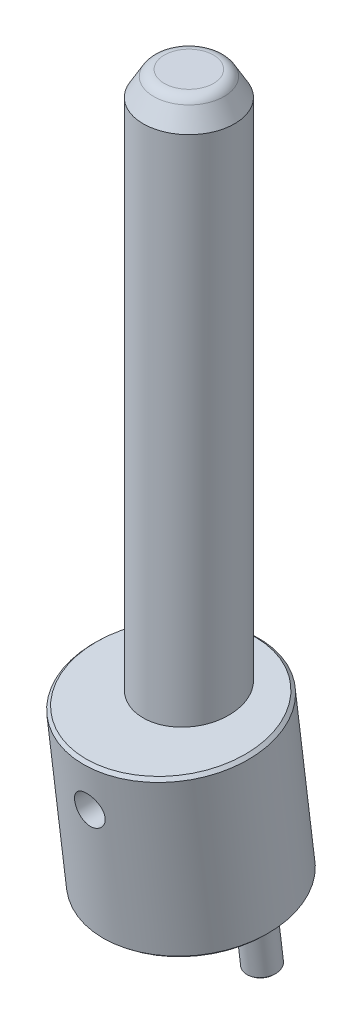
ISO-10303-21;
HEADER;
FILE_DESCRIPTION(('STEP AP214'),'2;1');
FILE_NAME('part.step','',(''),(''),'','','');
FILE_SCHEMA(('AUTOMOTIVE_DESIGN { 1 0 10303 214 1 1 1 1 }'));
ENDSEC;
DATA;
#1=APPLICATION_CONTEXT('core data for automotive mechanical design processes');
#2=APPLICATION_PROTOCOL_DEFINITION('international standard','automotive_design',2000,#1);
#3=PRODUCT_CONTEXT('',#1,'mechanical');
#4=PRODUCT('Part','Part','',(#3));
#5=PRODUCT_RELATED_PRODUCT_CATEGORY('part','',(#4));
#6=PRODUCT_DEFINITION_FORMATION('','',#4);
#7=PRODUCT_DEFINITION_CONTEXT('part definition',#1,'design');
#8=PRODUCT_DEFINITION('design','',#6,#7);
#9=PRODUCT_DEFINITION_SHAPE('','',#8);
#10=(LENGTH_UNIT() NAMED_UNIT(*) SI_UNIT(.MILLI.,.METRE.));
#11=(NAMED_UNIT(*) PLANE_ANGLE_UNIT() SI_UNIT($,.RADIAN.));
#12=(NAMED_UNIT(*) SI_UNIT($,.STERADIAN.) SOLID_ANGLE_UNIT());
#13=UNCERTAINTY_MEASURE_WITH_UNIT(LENGTH_MEASURE(1.E-05),#10,'distance_accuracy_value','');
#14=(GEOMETRIC_REPRESENTATION_CONTEXT(3) GLOBAL_UNCERTAINTY_ASSIGNED_CONTEXT((#13)) GLOBAL_UNIT_ASSIGNED_CONTEXT((#10,
#11,#12)) REPRESENTATION_CONTEXT('',''));
#15=CARTESIAN_POINT('',(0.,0.,0.));
#16=DIRECTION('',(0.,0.,1.));
#17=DIRECTION('',(1.,0.,0.));
#18=AXIS2_PLACEMENT_3D('',#15,#16,#17);
#19=CARTESIAN_POINT('',(0.,-25.2094466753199,-2.57557712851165));
#20=DIRECTION('',(0.,-0.992546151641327,-0.121869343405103));
#21=DIRECTION('',(0.,0.121869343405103,-0.992546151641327));
#22=AXIS2_PLACEMENT_3D('',#19,#20,#21);
#23=PLANE('',#22);
#24=CARTESIAN_POINT('',(-21.5,-25.2094466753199,-2.57557712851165));
#25=DIRECTION('',(0.,-0.992546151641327,-0.121869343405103));
#26=DIRECTION('',(0.,0.121869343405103,-0.992546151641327));
#27=AXIS2_PLACEMENT_3D('',#24,#25,#26);
#28=CIRCLE('',#27,4.50000075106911);
#29=CARTESIAN_POINT('',(-21.5,-24.6610345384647,-7.04203555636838));
#30=VERTEX_POINT('',#29);
#31=EDGE_CURVE('P0_E17',#30,#30,#28,.F.);
#32=ORIENTED_EDGE('',*,*,#31,.F.);
#33=EDGE_LOOP('',(#32));
#34=FACE_BOUND('',#33,.T.);
#35=ADVANCED_FACE('P0_F14',(#34),#23,.T.);
#36=CARTESIAN_POINT('',(0.,-25.2094466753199,-2.57557712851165));
#37=DIRECTION('',(0.,-0.992546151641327,-0.121869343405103));
#38=DIRECTION('',(0.,0.121869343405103,-0.992546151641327));
#39=AXIS2_PLACEMENT_3D('',#36,#37,#38);
#40=PLANE('',#39);
#41=CARTESIAN_POINT('',(21.5,-25.2094466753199,-2.57557712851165));
#42=DIRECTION('',(0.,-0.992546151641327,-0.121869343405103));
#43=DIRECTION('',(0.,0.121869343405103,-0.992546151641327));
#44=AXIS2_PLACEMENT_3D('',#41,#42,#43);
#45=CIRCLE('',#44,4.50000075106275);
#46=CARTESIAN_POINT('',(21.5,-24.6610345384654,-7.04203555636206));
#47=VERTEX_POINT('',#46);
#48=EDGE_CURVE('P0_E121',#47,#47,#45,.F.);
#49=ORIENTED_EDGE('',*,*,#48,.F.);
#50=EDGE_LOOP('',(#49));
#51=FACE_BOUND('',#50,.T.);
#52=ADVANCED_FACE('P0_F111',(#51),#40,.T.);
#53=CARTESIAN_POINT('',(0.,3.12944115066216E-12,-4.77482636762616E-13));
#54=DIRECTION('',(0.,-1.,0.));
#55=DIRECTION('',(0.,0.,-1.));
#56=AXIS2_PLACEMENT_3D('',#53,#54,#55);
#57=PLANE('',#56);
#58=CARTESIAN_POINT('',(0.,2.90045765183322E-12,-2.59850734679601E-12));
#59=DIRECTION('',(0.,-1.,0.));
#60=DIRECTION('',(0.,0.,-1.));
#61=AXIS2_PLACEMENT_3D('',#58,#59,#60);
#62=CIRCLE('',#61,15.);
#63=CARTESIAN_POINT('',(0.,2.90045765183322E-12,-15.0000000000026));
#64=VERTEX_POINT('',#63);
#65=EDGE_CURVE('P0_E36',#64,#64,#62,.F.);
#66=ORIENTED_EDGE('',*,*,#65,.T.);
#67=EDGE_LOOP('',(#66));
#68=FACE_BOUND('',#67,.T.);
#69=ADVANCED_FACE('P0_F108',(#68),#57,.F.);
#70=CARTESIAN_POINT('',(-21.5,-24.7131730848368,-2.51464239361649));
#71=DIRECTION('',(0.,0.992546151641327,0.121869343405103));
#72=DIRECTION('',(0.,-0.121869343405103,0.992546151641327));
#73=AXIS2_PLACEMENT_3D('',#70,#71,#72);
#74=CONICAL_SURFACE('',#73,5.00000135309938,0.785398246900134);
#75=CARTESIAN_POINT('',(-21.5,-24.7131717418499,-2.51464222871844));
#76=DIRECTION('',(0.,-0.992546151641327,-0.121869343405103));
#77=DIRECTION('',(0.,0.121869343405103,-0.992546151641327));
#78=AXIS2_PLACEMENT_3D('',#75,#76,#77);
#79=CIRCLE('',#78,5.);
#80=CARTESIAN_POINT('',(-21.5,-24.1038250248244,-7.47737298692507));
#81=VERTEX_POINT('',#80);
#82=EDGE_CURVE('P0_E33',#81,#81,#79,.F.);
#83=ORIENTED_EDGE('',*,*,#82,.F.);
#84=EDGE_LOOP('',(#83));
#85=FACE_BOUND('',#84,.T.);
#86=ORIENTED_EDGE('',*,*,#31,.T.);
#87=EDGE_LOOP('',(#86));
#88=FACE_BOUND('',#87,.T.);
#89=ADVANCED_FACE('P0_F104',(#85,#88),#74,.T.);
#90=CARTESIAN_POINT('',(21.5,-24.7131730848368,-2.51464239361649));
#91=DIRECTION('',(0.,0.992546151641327,0.121869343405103));
#92=DIRECTION('',(0.,-0.121869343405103,0.992546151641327));
#93=AXIS2_PLACEMENT_3D('',#90,#91,#92);
#94=CONICAL_SURFACE('',#93,5.00000135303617,0.785398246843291);
#95=CARTESIAN_POINT('',(21.5,-24.7131717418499,-2.51464222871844));
#96=DIRECTION('',(0.,-0.992546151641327,-0.121869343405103));
#97=DIRECTION('',(0.,0.121869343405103,-0.992546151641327));
#98=AXIS2_PLACEMENT_3D('',#95,#96,#97);
#99=CIRCLE('',#98,5.);
#100=CARTESIAN_POINT('',(21.5,-24.1038250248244,-7.47737298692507));
#101=VERTEX_POINT('',#100);
#102=EDGE_CURVE('P0_E29',#101,#101,#99,.F.);
#103=ORIENTED_EDGE('',*,*,#102,.F.);
#104=EDGE_LOOP('',(#103));
#105=FACE_BOUND('',#104,.T.);
#106=ORIENTED_EDGE('',*,*,#48,.T.);
#107=EDGE_LOOP('',(#106));
#108=FACE_BOUND('',#107,.T.);
#109=ADVANCED_FACE('P0_F99',(#105,#108),#94,.T.);
#110=CARTESIAN_POINT('',(0.,59.7458556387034,-2.59872418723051E-12));
#111=DIRECTION('',(0.,-1.,0.));
#112=DIRECTION('',(0.,0.,-1.));
#113=AXIS2_PLACEMENT_3D('',#110,#111,#112);
#114=CYLINDRICAL_SURFACE('',#113,15.);
#115=CARTESIAN_POINT('',(0.,45.0000000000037,-2.59959154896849E-12));
#116=DIRECTION('',(0.,0.992546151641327,0.121869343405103));
#117=DIRECTION('',(0.,-0.121869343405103,0.992546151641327));
#118=AXIS2_PLACEMENT_3D('',#115,#116,#117);
#119=ELLIPSE('',#118,15.1126473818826,15.);
#120=CARTESIAN_POINT('',(0.,43.1582315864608,14.9999999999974));
#121=VERTEX_POINT('',#120);
#122=EDGE_CURVE('P0_E32',#121,#121,#119,.F.);
#123=ORIENTED_EDGE('',*,*,#122,.F.);
#124=EDGE_LOOP('',(#123));
#125=FACE_BOUND('',#124,.T.);
#126=ORIENTED_EDGE('',*,*,#65,.F.);
#127=EDGE_LOOP('',(#126));
#128=FACE_BOUND('',#127,.T.);
#129=CARTESIAN_POINT('',(0.,31.0000000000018,14.9999999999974));
#130=CARTESIAN_POINT('',(-0.13627460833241,30.9999999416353,14.9999999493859));
#131=CARTESIAN_POINT('',(-0.27255067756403,30.9944241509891,14.9981386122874));
#132=CARTESIAN_POINT('',(-0.544142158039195,30.9721706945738,14.9907428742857));
#133=CARTESIAN_POINT('',(-0.679457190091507,30.9554888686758,14.9852070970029));
#134=CARTESIAN_POINT('',(-0.948257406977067,30.9111491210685,14.9706027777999));
#135=CARTESIAN_POINT('',(-1.08174007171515,30.8834773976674,14.9615297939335));
#136=CARTESIAN_POINT('',(-1.34580155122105,30.8174009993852,14.9400929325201));
#137=CARTESIAN_POINT('',(-1.47637921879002,30.7789921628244,14.9277277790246));
#138=CARTESIAN_POINT('',(-1.7333461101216,30.6918928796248,14.9000723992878));
#139=CARTESIAN_POINT('',(-1.85974572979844,30.6432305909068,14.8847901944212));
#140=CARTESIAN_POINT('',(-2.10792399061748,30.5359631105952,14.8516789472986));
#141=CARTESIAN_POINT('',(-2.22970089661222,30.4773542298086,14.8338489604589));
#142=CARTESIAN_POINT('',(-2.58680471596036,30.2873070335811,14.7772227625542));
#143=CARTESIAN_POINT('',(-2.81420620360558,30.1415453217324,14.735256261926));
#144=CARTESIAN_POINT('',(-3.24874257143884,29.8108587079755,14.6457020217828));
#145=CARTESIAN_POINT('',(-3.45501840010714,29.6248491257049,14.5979792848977));
#146=CARTESIAN_POINT('',(-3.8341436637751,29.2211801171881,14.5030192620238));
#147=CARTESIAN_POINT('',(-4.0069839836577,29.0035120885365,14.4557821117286));
#148=CARTESIAN_POINT('',(-4.31912807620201,28.5350726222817,14.3656662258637));
#149=CARTESIAN_POINT('',(-4.45732572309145,28.2835298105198,14.322951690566));
#150=CARTESIAN_POINT('',(-4.68909399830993,27.7591186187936,14.2487652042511));
#151=CARTESIAN_POINT('',(-4.78267844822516,27.4862568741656,14.2172897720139));
#152=CARTESIAN_POINT('',(-4.91936749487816,26.9366338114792,14.1705651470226));
#153=CARTESIAN_POINT('',(-4.96406724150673,26.6603139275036,14.1548047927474));
#154=CARTESIAN_POINT('',(-5.00670561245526,26.1036813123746,14.1397828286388));
#155=CARTESIAN_POINT('',(-5.00465868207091,25.8233698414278,14.1405161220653));
#156=CARTESIAN_POINT('',(-4.95509941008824,25.280317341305,14.1579507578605));
#157=CARTESIAN_POINT('',(-4.90966912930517,25.0173587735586,14.1739208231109));
#158=CARTESIAN_POINT('',(-4.77803186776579,24.5030345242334,14.2188326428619));
#159=CARTESIAN_POINT('',(-4.69181981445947,24.2516702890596,14.2477760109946));
#160=CARTESIAN_POINT('',(-4.47968995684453,23.7629279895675,14.3158968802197));
#161=CARTESIAN_POINT('',(-4.3531541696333,23.5258408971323,14.355231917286));
#162=CARTESIAN_POINT('',(-4.06444611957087,23.0756402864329,14.4396288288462));
#163=CARTESIAN_POINT('',(-3.90226546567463,22.8625324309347,14.484692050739));
#164=CARTESIAN_POINT('',(-3.53674216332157,22.4545530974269,14.5783642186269));
#165=CARTESIAN_POINT('',(-3.33169626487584,22.2612084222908,14.6270356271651));
#166=CARTESIAN_POINT('',(-3.00176707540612,21.9988448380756,14.6970107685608));
#167=CARTESIAN_POINT('',(-2.88796886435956,21.9159467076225,14.7198467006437));
#168=CARTESIAN_POINT('',(-2.65358317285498,21.7599196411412,14.763897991));
#169=CARTESIAN_POINT('',(-2.53299841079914,21.6867868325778,14.7851139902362));
#170=CARTESIAN_POINT('',(-2.28442944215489,21.5500863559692,14.8255663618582));
#171=CARTESIAN_POINT('',(-2.15637801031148,21.4866337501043,14.8447781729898));
#172=CARTESIAN_POINT('',(-1.89503347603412,21.3708247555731,14.880397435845));
#173=CARTESIAN_POINT('',(-1.76174256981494,21.3184637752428,14.8968060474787));
#174=CARTESIAN_POINT('',(-1.49104566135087,21.2253547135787,14.9263287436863));
#175=CARTESIAN_POINT('',(-1.3536464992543,21.1845884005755,14.9394479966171));
#176=CARTESIAN_POINT('',(-1.0756272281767,21.1149668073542,14.9620340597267));
#177=CARTESIAN_POINT('',(-0.93500858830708,21.0861062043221,14.9715025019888));
#178=CARTESIAN_POINT('',(-0.662330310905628,21.0422867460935,14.9859443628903));
#179=CARTESIAN_POINT('',(-0.530427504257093,21.0264417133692,14.9912035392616));
#180=CARTESIAN_POINT('',(-0.265683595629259,21.0052983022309,14.9982313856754));
#181=CARTESIAN_POINT('',(-0.132842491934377,20.9999999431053,15.0000000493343));
#182=CARTESIAN_POINT('',(0.136274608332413,21.0000000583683,14.9999999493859));
#183=CARTESIAN_POINT('',(0.272550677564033,21.0055758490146,14.9981386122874));
#184=CARTESIAN_POINT('',(0.544142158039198,21.0278293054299,14.9907428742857));
#185=CARTESIAN_POINT('',(0.67945719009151,21.0445111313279,14.9852070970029));
#186=CARTESIAN_POINT('',(0.94825740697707,21.0888508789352,14.9706027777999));
#187=CARTESIAN_POINT('',(1.08174007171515,21.1165226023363,14.9615297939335));
#188=CARTESIAN_POINT('',(1.34580155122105,21.1825990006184,14.9400929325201));
#189=CARTESIAN_POINT('',(1.47637921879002,21.2210078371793,14.9277277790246));
#190=CARTESIAN_POINT('',(1.7333461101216,21.3081071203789,14.9000723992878));
#191=CARTESIAN_POINT('',(1.85974572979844,21.3567694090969,14.8847901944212));
#192=CARTESIAN_POINT('',(2.10792399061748,21.4640368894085,14.8516789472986));
#193=CARTESIAN_POINT('',(2.22970089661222,21.5226457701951,14.8338489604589));
#194=CARTESIAN_POINT('',(2.58680471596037,21.7126929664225,14.7772227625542));
#195=CARTESIAN_POINT('',(2.81420620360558,21.8584546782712,14.735256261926));
#196=CARTESIAN_POINT('',(3.24874257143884,22.1891412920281,14.6457020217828));
#197=CARTESIAN_POINT('',(3.45501840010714,22.3751508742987,14.5979792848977));
#198=CARTESIAN_POINT('',(3.8341436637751,22.7788198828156,14.5030192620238));
#199=CARTESIAN_POINT('',(4.0069839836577,22.9964879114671,14.4557821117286));
#200=CARTESIAN_POINT('',(4.31912807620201,23.464927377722,14.3656662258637));
#201=CARTESIAN_POINT('',(4.45732572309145,23.7164701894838,14.322951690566));
#202=CARTESIAN_POINT('',(4.68909399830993,24.24088138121,14.2487652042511));
#203=CARTESIAN_POINT('',(4.78267844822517,24.5137431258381,14.2172897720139));
#204=CARTESIAN_POINT('',(4.91936749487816,25.0633661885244,14.1705651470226));
#205=CARTESIAN_POINT('',(4.96406724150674,25.3396860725,14.1548047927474));
#206=CARTESIAN_POINT('',(5.00670561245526,25.896318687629,14.1397828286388));
#207=CARTESIAN_POINT('',(5.00465868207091,26.1766301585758,14.1405161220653));
#208=CARTESIAN_POINT('',(4.95509941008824,26.7196826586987,14.1579507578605));
#209=CARTESIAN_POINT('',(4.90966912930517,26.982641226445,14.1739208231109));
#210=CARTESIAN_POINT('',(4.77803186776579,27.4969654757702,14.2188326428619));
#211=CARTESIAN_POINT('',(4.69181981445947,27.748329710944,14.2477760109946));
#212=CARTESIAN_POINT('',(4.47968995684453,28.2370720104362,14.3158968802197));
#213=CARTESIAN_POINT('',(4.35315416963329,28.4741591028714,14.355231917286));
#214=CARTESIAN_POINT('',(4.06444611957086,28.9243597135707,14.4396288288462));
#215=CARTESIAN_POINT('',(3.90226546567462,29.1374675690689,14.484692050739));
#216=CARTESIAN_POINT('',(3.53674216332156,29.5454469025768,14.5783642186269));
#217=CARTESIAN_POINT('',(3.33169626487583,29.7387915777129,14.6270356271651));
#218=CARTESIAN_POINT('',(3.00176707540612,30.0011551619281,14.6970107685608));
#219=CARTESIAN_POINT('',(2.88796886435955,30.0840532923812,14.7198467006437));
#220=CARTESIAN_POINT('',(2.65358317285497,30.2400803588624,14.763897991));
#221=CARTESIAN_POINT('',(2.53299841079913,30.3132131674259,14.7851139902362));
#222=CARTESIAN_POINT('',(2.28442944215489,30.4499136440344,14.8255663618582));
#223=CARTESIAN_POINT('',(2.15637801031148,30.5133662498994,14.8447781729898));
#224=CARTESIAN_POINT('',(1.89503347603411,30.6291752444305,14.880397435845));
#225=CARTESIAN_POINT('',(1.76174256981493,30.6815362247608,14.8968060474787));
#226=CARTESIAN_POINT('',(1.49104566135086,30.7746452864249,14.9263287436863));
#227=CARTESIAN_POINT('',(1.3536464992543,30.8154115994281,14.9394479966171));
#228=CARTESIAN_POINT('',(1.0756272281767,30.8850331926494,14.9620340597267));
#229=CARTESIAN_POINT('',(0.935008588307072,30.9138937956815,14.9715025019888));
#230=CARTESIAN_POINT('',(0.662330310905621,30.9577132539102,14.9859443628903));
#231=CARTESIAN_POINT('',(0.530427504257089,30.9735582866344,14.9912035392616));
#232=CARTESIAN_POINT('',(0.265683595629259,30.9947016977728,14.9982313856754));
#233=CARTESIAN_POINT('',(0.132842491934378,31.0000000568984,15.0000000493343));
#234=CARTESIAN_POINT('',(0.,31.0000000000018,14.9999999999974));
#235=B_SPLINE_CURVE_WITH_KNOTS('',3,(#129,#130,#131,#132,#133,#134,#135,#136,#137,#138,#139,
#140,#141,#142,#143,#144,#145,#146,#147,#148,#149,#150,#151,#152,#153,#154,#155,#156,#157,#158,
#159,#160,#161,#162,#163,#164,#165,#166,#167,#168,#169,#170,#171,#172,#173,#174,#175,#176,#177,
#178,#179,#180,#181,#182,#183,#184,#185,#186,#187,#188,#189,#190,#191,#192,#193,#194,#195,#196,
#197,#198,#199,#200,#201,#202,#203,#204,#205,#206,#207,#208,#209,#210,#211,#212,#213,#214,#215,
#216,#217,#218,#219,#220,#221,#222,#223,#224,#225,#226,#227,#228,#229,#230,#231,#232,#233,#234),
.UNSPECIFIED.,.T.,.F.,(4,2,2,2,2,2,2,2,2,2,2,2,2,2,2,2,2,2,2,2,2,2,2,2,2,2,2,2,2,2,2,2,2,2,2,2,
2,2,2,2,2,2,2,2,2,2,2,2,2,2,2,2,4),(0.,0.408700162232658,0.817553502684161,1.22692193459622,
1.6364492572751,2.04486626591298,2.45343508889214,3.26962321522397,4.11140352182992,
4.9534129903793,5.81961254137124,6.68554356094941,7.52228757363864,8.35877302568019,
9.15703078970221,9.95538786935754,10.7666215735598,11.5780464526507,12.4317109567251,
12.8591940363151,13.286507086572,13.7185586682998,14.150431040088,14.5816205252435,
15.0126170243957,15.4110232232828,15.8094301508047,16.2181303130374,16.6269836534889,
17.0363520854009,17.4458794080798,17.8542964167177,18.2628652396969,19.0790533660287,
19.9208336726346,20.762843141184,21.629042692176,22.4949737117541,23.3317177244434,
24.1682031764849,24.9664609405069,25.7648180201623,26.5760517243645,27.3874766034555,
28.2411411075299,28.6686241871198,29.0959372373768,29.5279888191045,29.9598611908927,
30.3910506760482,30.8220471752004,31.2204533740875,31.6188603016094),.UNSPECIFIED.);
#236=CARTESIAN_POINT('',(0.,31.0000000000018,14.9999999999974));
#237=VERTEX_POINT('',#236);
#238=EDGE_CURVE('P0_E84',#237,#237,#235,.T.);
#239=ORIENTED_EDGE('',*,*,#238,.T.);
#240=EDGE_LOOP('',(#239));
#241=FACE_BOUND('',#240,.T.);
#242=ADVANCED_FACE('P0_F93',(#125,#128,#241),#114,.F.);
#243=CARTESIAN_POINT('',(-21.5,-10.3212544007,-0.7475369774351));
#244=DIRECTION('',(0.,-0.992546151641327,-0.121869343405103));
#245=DIRECTION('',(0.,0.121869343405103,-0.992546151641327));
#246=AXIS2_PLACEMENT_3D('',#243,#244,#245);
#247=CYLINDRICAL_SURFACE('',#246,5.);
#248=CARTESIAN_POINT('',(-21.5,-10.3212544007,-0.7475369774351));
#249=DIRECTION('',(0.,-0.992546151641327,-0.121869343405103));
#250=DIRECTION('',(0.,0.121869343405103,-0.992546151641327));
#251=AXIS2_PLACEMENT_3D('',#248,#249,#250);
#252=CIRCLE('',#251,5.);
#253=CARTESIAN_POINT('',(-21.5,-9.71190768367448,-5.71026773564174));
#254=VERTEX_POINT('',#253);
#255=EDGE_CURVE('P0_E80',#254,#254,#252,.T.);
#256=ORIENTED_EDGE('',*,*,#255,.T.);
#257=EDGE_LOOP('',(#256));
#258=FACE_BOUND('',#257,.T.);
#259=ORIENTED_EDGE('',*,*,#82,.T.);
#260=EDGE_LOOP('',(#259));
#261=FACE_BOUND('',#260,.T.);
#262=ADVANCED_FACE('P0_F98',(#258,#261),#247,.T.);
#263=CARTESIAN_POINT('',(21.5,-10.3212544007,-0.7475369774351));
#264=DIRECTION('',(0.,-0.992546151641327,-0.121869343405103));
#265=DIRECTION('',(0.,0.121869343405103,-0.992546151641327));
#266=AXIS2_PLACEMENT_3D('',#263,#264,#265);
#267=CYLINDRICAL_SURFACE('',#266,5.);
#268=CARTESIAN_POINT('',(21.5,-10.3212544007,-0.7475369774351));
#269=DIRECTION('',(0.,-0.992546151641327,-0.121869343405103));
#270=DIRECTION('',(0.,0.121869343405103,-0.992546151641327));
#271=AXIS2_PLACEMENT_3D('',#268,#269,#270);
#272=CIRCLE('',#271,5.);
#273=CARTESIAN_POINT('',(21.5,-9.71190768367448,-5.71026773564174));
#274=VERTEX_POINT('',#273);
#275=EDGE_CURVE('P0_E76',#274,#274,#272,.T.);
#276=ORIENTED_EDGE('',*,*,#275,.T.);
#277=EDGE_LOOP('',(#276));
#278=FACE_BOUND('',#277,.T.);
#279=ORIENTED_EDGE('',*,*,#102,.T.);
#280=EDGE_LOOP('',(#279));
#281=FACE_BOUND('',#280,.T.);
#282=ADVANCED_FACE('P0_F178',(#278,#281),#267,.T.);
#283=CARTESIAN_POINT('',(0.,44.268783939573,5.95527690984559));
#284=DIRECTION('',(0.,0.992546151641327,0.121869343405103));
#285=DIRECTION('',(0.,-0.121869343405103,0.992546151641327));
#286=AXIS2_PLACEMENT_3D('',#283,#284,#285);
#287=PLANE('',#286);
#288=ORIENTED_EDGE('',*,*,#122,.T.);
#289=EDGE_LOOP('',(#288));
#290=FACE_BOUND('',#289,.T.);
#291=CARTESIAN_POINT('',(0.,44.268783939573,5.95527690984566));
#292=DIRECTION('',(0.,0.992546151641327,0.121869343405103));
#293=DIRECTION('',(0.,-0.121869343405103,0.992546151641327));
#294=AXIS2_PLACEMENT_3D('',#291,#292,#293);
#295=CIRCLE('',#294,27.9999945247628);
#296=CARTESIAN_POINT('',(0.,40.8564429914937,33.7465637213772));
#297=VERTEX_POINT('',#296);
#298=EDGE_CURVE('P0_E46',#297,#297,#295,.F.);
#299=ORIENTED_EDGE('',*,*,#298,.F.);
#300=EDGE_LOOP('',(#299));
#301=FACE_BOUND('',#300,.T.);
#302=ADVANCED_FACE('P0_F71',(#290,#301),#287,.T.);
#303=CARTESIAN_POINT('',(0.,26.0000000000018,-4.49837953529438));
#304=DIRECTION('',(0.,0.,1.));
#305=DIRECTION('',(0.,-1.,0.));
#306=AXIS2_PLACEMENT_3D('',#303,#304,#305);
#307=CYLINDRICAL_SURFACE('',#306,5.);
#308=ORIENTED_EDGE('',*,*,#238,.F.);
#309=EDGE_LOOP('',(#308));
#310=FACE_BOUND('',#309,.T.);
#311=CARTESIAN_POINT('',(0.,21.0000000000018,32.3160144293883));
#312=CARTESIAN_POINT('',(-0.1403461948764,21.0000006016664,32.3160142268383));
#313=CARTESIAN_POINT('',(-0.280708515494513,21.0059135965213,32.315711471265));
#314=CARTESIAN_POINT('',(-0.560489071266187,21.0295298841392,32.3145230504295));
#315=CARTESIAN_POINT('',(-0.699906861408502,21.0472383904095,32.3136371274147));
#316=CARTESIAN_POINT('',(-0.976970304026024,21.094359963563,32.3113500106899));
#317=CARTESIAN_POINT('',(-1.11461288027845,21.1237911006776,32.3099480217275));
#318=CARTESIAN_POINT('',(-1.38697401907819,21.1941604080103,32.3067422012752));
#319=CARTESIAN_POINT('',(-1.52169146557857,21.2351028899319,32.3049382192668));
#320=CARTESIAN_POINT('',(-1.78703419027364,21.3281426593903,32.3010858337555));
#321=CARTESIAN_POINT('',(-1.91766413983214,21.3802266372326,32.2990377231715));
#322=CARTESIAN_POINT('',(-2.17412119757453,21.4952299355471,32.2948846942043));
#323=CARTESIAN_POINT('',(-2.29994651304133,21.5581532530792,32.2927797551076));
#324=CARTESIAN_POINT('',(-2.54575621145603,21.6943233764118,32.2887356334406));
#325=CARTESIAN_POINT('',(-2.66574505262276,21.7675621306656,32.2867963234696));
#326=CARTESIAN_POINT('',(-2.89917970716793,21.9239113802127,32.2833237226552));
#327=CARTESIAN_POINT('',(-3.01262309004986,22.0070255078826,32.2817905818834));
#328=CARTESIAN_POINT('',(-3.232146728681,22.1825423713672,32.2793890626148));
#329=CARTESIAN_POINT('',(-3.33822469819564,22.2749479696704,32.2785208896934));
#330=CARTESIAN_POINT('',(-3.5422598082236,22.4684045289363,32.2777149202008));
#331=CARTESIAN_POINT('',(-3.64021392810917,22.5694586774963,32.2777774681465));
#332=CARTESIAN_POINT('',(-3.82722424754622,22.7794235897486,32.2790961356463));
#333=CARTESIAN_POINT('',(-3.91628336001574,22.8883317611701,32.2803518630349));
#334=CARTESIAN_POINT('',(-4.08493121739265,23.1132880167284,32.2843069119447));
#335=CARTESIAN_POINT('',(-4.16451648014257,23.2293387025,32.2870067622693));
#336=CARTESIAN_POINT('',(-4.31322552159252,23.4670878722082,32.294060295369));
#337=CARTESIAN_POINT('',(-4.38240064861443,23.5887544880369,32.2984054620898));
#338=CARTESIAN_POINT('',(-4.51030821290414,23.8374364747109,32.3089450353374));
#339=CARTESIAN_POINT('',(-4.56903679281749,23.9644537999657,32.3151401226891));
#340=CARTESIAN_POINT('',(-4.67558894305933,24.2228181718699,32.3295311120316));
#341=CARTESIAN_POINT('',(-4.72341729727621,24.354163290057,32.3377261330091));
#342=CARTESIAN_POINT('',(-4.80789683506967,24.6202704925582,32.3562192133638));
#343=CARTESIAN_POINT('',(-4.84454391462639,24.7550338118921,32.3665180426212));
#344=CARTESIAN_POINT('',(-4.93688227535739,25.1611177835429,32.4005185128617));
#345=CARTESIAN_POINT('',(-4.9757781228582,25.4362013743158,32.4274299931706));
#346=CARTESIAN_POINT('',(-5.00762672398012,25.9879273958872,32.4895650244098));
#347=CARTESIAN_POINT('',(-5.00057783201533,26.2645698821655,32.5247888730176));
#348=CARTESIAN_POINT('',(-4.94109053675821,26.81396350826,32.6026732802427));
#349=CARTESIAN_POINT('',(-4.88831502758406,27.086670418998,32.6453871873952));
#350=CARTESIAN_POINT('',(-4.7387120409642,27.6189440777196,32.7361104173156));
#351=CARTESIAN_POINT('',(-4.64187793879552,27.8785088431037,32.7841205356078));
#352=CARTESIAN_POINT('',(-4.46456377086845,28.2555797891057,32.8586334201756));
#353=CARTESIAN_POINT('',(-4.39916939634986,28.3805882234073,32.8841965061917));
#354=CARTESIAN_POINT('',(-4.25809696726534,28.6245830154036,32.935611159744));
#355=CARTESIAN_POINT('',(-4.18242246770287,28.7435714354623,32.9614626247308));
#356=CARTESIAN_POINT('',(-4.02125558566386,28.9747907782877,33.0130529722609));
#357=CARTESIAN_POINT('',(-3.93575922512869,29.0870189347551,33.0387918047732));
#358=CARTESIAN_POINT('',(-3.75555564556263,29.3038867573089,33.0897102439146));
#359=CARTESIAN_POINT('',(-3.66085184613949,29.4085292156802,33.114890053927));
#360=CARTESIAN_POINT('',(-3.46147534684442,29.6109051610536,33.1645984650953));
#361=CARTESIAN_POINT('',(-3.35668562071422,29.708526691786,33.1891137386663));
#362=CARTESIAN_POINT('',(-3.13896542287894,29.8945330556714,33.2366741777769));
#363=CARTESIAN_POINT('',(-3.02603811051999,29.98292144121,33.2597199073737));
#364=CARTESIAN_POINT('',(-2.79266578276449,30.149893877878,33.303929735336));
#365=CARTESIAN_POINT('',(-2.67221491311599,30.2284701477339,33.3250923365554));
#366=CARTESIAN_POINT('',(-2.42475245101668,30.3750711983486,33.3650874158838));
#367=CARTESIAN_POINT('',(-2.29774365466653,30.4431004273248,33.3839208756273));
#368=CARTESIAN_POINT('',(-2.04039417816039,30.5669254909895,33.4185615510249));
#369=CARTESIAN_POINT('',(-1.91015664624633,30.6229219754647,33.4344177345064));
#370=CARTESIAN_POINT('',(-1.6451638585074,30.7237189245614,33.4631901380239));
#371=CARTESIAN_POINT('',(-1.51041056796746,30.7685241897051,33.4761076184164));
#372=CARTESIAN_POINT('',(-1.23759367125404,30.8464886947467,33.4987168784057));
#373=CARTESIAN_POINT('',(-1.09953687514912,30.8796700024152,33.5084147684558));
#374=CARTESIAN_POINT('',(-0.820969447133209,30.9341801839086,33.5244053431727));
#375=CARTESIAN_POINT('',(-0.680460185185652,30.9555154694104,33.5306998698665));
#376=CARTESIAN_POINT('',(-0.449764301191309,30.9805445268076,33.5380965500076));
#377=CARTESIAN_POINT('',(-0.359985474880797,30.9878372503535,33.5402559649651));
#378=CARTESIAN_POINT('',(-0.180141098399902,30.9975652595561,33.5431378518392));
#379=CARTESIAN_POINT('',(-0.0900755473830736,31.0000005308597,33.5438603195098));
#380=CARTESIAN_POINT('',(0.13670924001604,30.9999991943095,33.5438596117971));
#381=CARTESIAN_POINT('',(0.273441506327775,30.9943875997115,33.5421943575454));
#382=CARTESIAN_POINT('',(0.545961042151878,30.9719848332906,33.5355649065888));
#383=CARTESIAN_POINT('',(0.681747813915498,30.9551881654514,33.5305990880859));
#384=CARTESIAN_POINT('',(0.951565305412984,30.9105245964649,33.5174577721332));
#385=CARTESIAN_POINT('',(1.0855927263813,30.8826393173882,33.5092769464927));
#386=CARTESIAN_POINT('',(1.35075378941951,30.8160315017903,33.4898669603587));
#387=CARTESIAN_POINT('',(1.48188628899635,30.7773047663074,33.4786366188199));
#388=CARTESIAN_POINT('',(1.73998721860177,30.6894545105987,33.453381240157));
#389=CARTESIAN_POINT('',(1.86696488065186,30.6403561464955,33.4393629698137));
#390=CARTESIAN_POINT('',(2.11628565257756,30.5320871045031,33.408777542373));
#391=CARTESIAN_POINT('',(2.23862702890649,30.4729127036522,33.3922094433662));
#392=CARTESIAN_POINT('',(2.47775385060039,30.3450094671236,33.3568484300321));
#393=CARTESIAN_POINT('',(2.59454327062,30.2762876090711,33.3380571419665));
#394=CARTESIAN_POINT('',(2.82197975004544,30.1297387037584,33.2985701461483));
#395=CARTESIAN_POINT('',(2.93262446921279,30.0519082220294,33.2778737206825));
#396=CARTESIAN_POINT('',(3.149501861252,29.8858337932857,33.2344511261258));
#397=CARTESIAN_POINT('',(3.25557746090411,29.7973936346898,33.2116895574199));
#398=CARTESIAN_POINT('',(3.4599293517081,29.6121926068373,33.1649502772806));
#399=CARTESIAN_POINT('',(3.55820275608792,29.5154286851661,33.1409721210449));
#400=CARTESIAN_POINT('',(3.84035615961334,29.2136228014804,33.0678255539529));
#401=CARTESIAN_POINT('',(4.01174082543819,28.996935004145,33.017409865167));
#402=CARTESIAN_POINT('',(4.32137776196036,28.5311042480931,32.9149540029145));
#403=CARTESIAN_POINT('',(4.45839561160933,28.2811451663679,32.8629134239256));
#404=CARTESIAN_POINT('',(4.68824676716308,27.7609994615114,32.762066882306));
#405=CARTESIAN_POINT('',(4.78107919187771,27.4908124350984,32.7132609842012));
#406=CARTESIAN_POINT('',(4.91969612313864,26.9371411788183,32.6215885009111));
#407=CARTESIAN_POINT('',(4.96539505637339,26.6536337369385,32.5787328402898));
#408=CARTESIAN_POINT('',(5.00753076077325,26.0817237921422,32.5011046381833));
#409=CARTESIAN_POINT('',(5.0039747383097,25.793322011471,32.4663309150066));
#410=CARTESIAN_POINT('',(4.961795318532,25.3671635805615,32.4213989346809));
#411=CARTESIAN_POINT('',(4.94200263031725,25.2276707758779,32.4077374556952));
#412=CARTESIAN_POINT('',(4.8906765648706,24.9506761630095,32.382623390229));
#413=CARTESIAN_POINT('',(4.85914786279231,24.8131735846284,32.3711699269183));
#414=CARTESIAN_POINT('',(4.78452071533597,24.5411400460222,32.3504459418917));
#415=CARTESIAN_POINT('',(4.74141861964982,24.406610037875,32.3411761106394));
#416=CARTESIAN_POINT('',(4.64395547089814,24.1416145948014,32.324740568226));
#417=CARTESIAN_POINT('',(4.58959871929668,24.0111476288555,32.317574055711));
#418=CARTESIAN_POINT('',(4.47093290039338,23.757213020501,32.3053015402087));
#419=CARTESIAN_POINT('',(4.40679287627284,23.6336677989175,32.3001650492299));
#420=CARTESIAN_POINT('',(4.26843362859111,23.3923554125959,32.2916228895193));
#421=CARTESIAN_POINT('',(4.19421821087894,23.2745860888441,32.2882165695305));
#422=CARTESIAN_POINT('',(4.03618732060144,23.0455877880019,32.2829236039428));
#423=CARTESIAN_POINT('',(3.95236899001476,22.934360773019,32.2810374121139));
#424=CARTESIAN_POINT('',(3.77577258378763,22.7193152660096,32.2785533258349));
#425=CARTESIAN_POINT('',(3.68299773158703,22.6154941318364,32.2779549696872));
#426=CARTESIAN_POINT('',(3.48889112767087,22.4157175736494,32.2777953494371));
#427=CARTESIAN_POINT('',(3.38754011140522,22.3197808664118,32.2782364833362));
#428=CARTESIAN_POINT('',(3.17721816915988,22.1367485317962,32.279901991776));
#429=CARTESIAN_POINT('',(3.06825001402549,22.0496497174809,32.2811260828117));
#430=CARTESIAN_POINT('',(2.84333243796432,21.8847943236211,32.2841021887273));
#431=CARTESIAN_POINT('',(2.7273773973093,21.8070454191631,32.2858546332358));
#432=CARTESIAN_POINT('',(2.48942071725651,21.6615410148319,32.289640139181));
#433=CARTESIAN_POINT('',(2.36742127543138,21.5937819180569,32.2916730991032));
#434=CARTESIAN_POINT('',(2.11717785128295,21.4681885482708,32.295809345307));
#435=CARTESIAN_POINT('',(1.98889130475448,21.4104390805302,32.2979130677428));
#436=CARTESIAN_POINT('',(1.72795524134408,21.3059704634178,32.3019676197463));
#437=CARTESIAN_POINT('',(1.59530735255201,21.2592472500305,32.3039185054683));
#438=CARTESIAN_POINT('',(1.3267530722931,21.1771988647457,32.307492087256));
#439=CARTESIAN_POINT('',(1.19085200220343,21.1418562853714,32.3091152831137));
#440=CARTESIAN_POINT('',(0.91660692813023,21.0827349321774,32.3119018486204));
#441=CARTESIAN_POINT('',(0.778264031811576,21.0589510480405,32.3130654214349));
#442=CARTESIAN_POINT('',(0.533230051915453,21.0273666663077,32.3146304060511));
#443=CARTESIAN_POINT('',(0.426849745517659,21.0171083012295,32.3151473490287));
#444=CARTESIAN_POINT('',(0.213649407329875,21.0034247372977,32.3158394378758));
#445=CARTESIAN_POINT('',(0.106829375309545,20.999999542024,32.3160145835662));
#446=CARTESIAN_POINT('',(0.,21.0000000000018,32.3160144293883));
#447=B_SPLINE_CURVE_WITH_KNOTS('',3,(#311,#312,#313,#314,#315,#316,#317,#318,#319,#320,#321,
#322,#323,#324,#325,#326,#327,#328,#329,#330,#331,#332,#333,#334,#335,#336,#337,#338,#339,#340,
#341,#342,#343,#344,#345,#346,#347,#348,#349,#350,#351,#352,#353,#354,#355,#356,#357,#358,#359,
#360,#361,#362,#363,#364,#365,#366,#367,#368,#369,#370,#371,#372,#373,#374,#375,#376,#377,#378,
#379,#380,#381,#382,#383,#384,#385,#386,#387,#388,#389,#390,#391,#392,#393,#394,#395,#396,#397,
#398,#399,#400,#401,#402,#403,#404,#405,#406,#407,#408,#409,#410,#411,#412,#413,#414,#415,#416,
#417,#418,#419,#420,#421,#422,#423,#424,#425,#426,#427,#428,#429,#430,#431,#432,#433,#434,#435,
#436,#437,#438,#439,#440,#441,#442,#443,#444,#445,#446),.UNSPECIFIED.,.T.,.F.,(4,2,2,2,2,2,2,2,
2,2,2,2,2,2,2,2,2,2,2,2,2,2,2,2,2,2,2,2,2,2,2,2,2,2,2,2,2,2,2,2,2,2,2,2,2,2,2,2,2,2,2,2,2,2,2,2,
2,2,2,2,2,2,2,2,2,2,2,4),(0.,0.42094192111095,0.84207001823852,1.26384980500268,
1.68578778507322,2.10722450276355,2.5288169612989,2.95008215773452,3.37150278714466,
3.79305364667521,4.21476055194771,4.63632890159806,5.05805172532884,5.47762093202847,
5.89734474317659,6.31688398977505,6.73657704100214,7.56965242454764,8.40275764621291,
9.24205745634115,10.0814835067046,10.5112052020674,10.9407786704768,11.3705267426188,
11.8001158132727,12.2354872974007,12.6706906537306,13.1062369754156,13.5415991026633,
13.9690137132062,14.3962446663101,14.8226600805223,15.2488444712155,15.5190143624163,
15.7891850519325,16.199227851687,16.6094722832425,17.0203994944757,17.431486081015,
17.8415868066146,18.2518393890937,18.6617937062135,19.0719031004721,19.4913178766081,
19.9108871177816,20.7493761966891,21.6146719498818,22.4799849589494,23.3468662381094,
24.2136206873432,24.6378504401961,25.0619113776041,25.4861062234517,25.9101392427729,
26.327537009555,26.7447775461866,27.1621425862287,27.5793579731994,27.9975367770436,
28.4155642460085,28.833932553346,29.252149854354,29.6737535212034,30.0952015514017,
30.5160018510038,30.9366159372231,31.2570303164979,31.5774448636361),.UNSPECIFIED.);
#448=CARTESIAN_POINT('',(0.,21.0000000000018,32.3160144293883));
#449=VERTEX_POINT('',#448);
#450=EDGE_CURVE('P0_E39',#449,#449,#447,.T.);
#451=ORIENTED_EDGE('',*,*,#450,.F.);
#452=EDGE_LOOP('',(#451));
#453=FACE_BOUND('',#452,.T.);
#454=ADVANCED_FACE('P0_F48',(#310,#453),#307,.F.);
#455=CARTESIAN_POINT('',(0.,-10.3212544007,-0.7475369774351));
#456=DIRECTION('',(0.,0.992546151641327,0.121869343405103));
#457=DIRECTION('',(0.,-0.121869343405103,0.992546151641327));
#458=AXIS2_PLACEMENT_3D('',#455,#456,#457);
#459=PLANE('',#458);
#460=ORIENTED_EDGE('',*,*,#275,.F.);
#461=EDGE_LOOP('',(#460));
#462=FACE_BOUND('',#461,.T.);
#463=ORIENTED_EDGE('',*,*,#255,.F.);
#464=EDGE_LOOP('',(#463));
#465=FACE_BOUND('',#464,.T.);
#466=CARTESIAN_POINT('',(-1.28369537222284E-13,-10.3212544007,-0.74753697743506));
#467=DIRECTION('',(0.,0.992546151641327,0.121869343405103));
#468=DIRECTION('',(0.,-0.121869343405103,0.992546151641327));
#469=AXIS2_PLACEMENT_3D('',#466,#467,#468);
#470=CIRCLE('',#469,27.9999942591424);
#471=CARTESIAN_POINT('',(-1.28369537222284E-13,-13.7335953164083,27.0437495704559));
#472=VERTEX_POINT('',#471);
#473=EDGE_CURVE('P0_E26',#472,#472,#470,.T.);
#474=ORIENTED_EDGE('',*,*,#473,.F.);
#475=EDGE_LOOP('',(#474));
#476=FACE_BOUND('',#475,.T.);
#477=ADVANCED_FACE('P0_F63',(#462,#465,#476),#459,.F.);
#478=CARTESIAN_POINT('',(0.,43.2762348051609,5.83340720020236));
#479=DIRECTION('',(0.,-0.992546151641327,-0.121869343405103));
#480=DIRECTION('',(0.,0.121869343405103,-0.992546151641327));
#481=AXIS2_PLACEMENT_3D('',#478,#479,#480);
#482=CONICAL_SURFACE('',#481,28.9999973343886,0.785398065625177);
#483=ORIENTED_EDGE('',*,*,#298,.T.);
#484=EDGE_LOOP('',(#483));
#485=FACE_BOUND('',#484,.T.);
#486=CARTESIAN_POINT('',(0.,43.2762374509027,5.83340752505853));
#487=DIRECTION('',(0.,0.992546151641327,0.121869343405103));
#488=DIRECTION('',(0.,-0.121869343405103,0.992546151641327));
#489=AXIS2_PLACEMENT_3D('',#486,#487,#488);
#490=CIRCLE('',#489,29.);
#491=CARTESIAN_POINT('',(0.,39.7420264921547,34.617245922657));
#492=VERTEX_POINT('',#491);
#493=EDGE_CURVE('P0_E21',#492,#492,#490,.F.);
#494=ORIENTED_EDGE('',*,*,#493,.F.);
#495=EDGE_LOOP('',(#494));
#496=FACE_BOUND('',#495,.T.);
#497=ADVANCED_FACE('P0_F60',(#485,#496),#482,.T.);
#498=CARTESIAN_POINT('',(-1.28369537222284E-13,-9.32870509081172,-0.625667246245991));
#499=DIRECTION('',(0.,0.992546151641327,0.121869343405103));
#500=DIRECTION('',(0.,-0.121869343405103,0.992546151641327));
#501=AXIS2_PLACEMENT_3D('',#498,#499,#500);
#502=CONICAL_SURFACE('',#501,28.9999972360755,0.785398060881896);
#503=CARTESIAN_POINT('',(0.,-9.32870783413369,-0.625667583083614));
#504=DIRECTION('',(0.,0.992546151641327,0.121869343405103));
#505=DIRECTION('',(0.,-0.121869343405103,0.992546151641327));
#506=AXIS2_PLACEMENT_3D('',#503,#504,#505);
#507=CIRCLE('',#506,29.);
#508=CARTESIAN_POINT('',(0.,-12.8629187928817,28.1581708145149));
#509=VERTEX_POINT('',#508);
#510=EDGE_CURVE('P0_E9',#509,#509,#507,.T.);
#511=ORIENTED_EDGE('',*,*,#510,.F.);
#512=EDGE_LOOP('',(#511));
#513=FACE_BOUND('',#512,.T.);
#514=ORIENTED_EDGE('',*,*,#473,.T.);
#515=EDGE_LOOP('',(#514));
#516=FACE_BOUND('',#515,.T.);
#517=ADVANCED_FACE('P0_F56',(#513,#516),#502,.T.);
#518=CARTESIAN_POINT('',(0.,-13.0507563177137,-1.08267767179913));
#519=DIRECTION('',(0.,0.992546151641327,0.121869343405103));
#520=DIRECTION('',(0.,-0.121869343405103,0.992546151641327));
#521=AXIS2_PLACEMENT_3D('',#518,#519,#520);
#522=CYLINDRICAL_SURFACE('',#521,29.);
#523=ORIENTED_EDGE('',*,*,#493,.T.);
#524=EDGE_LOOP('',(#523));
#525=FACE_BOUND('',#524,.T.);
#526=ORIENTED_EDGE('',*,*,#510,.T.);
#527=EDGE_LOOP('',(#526));
#528=FACE_BOUND('',#527,.T.);
#529=ORIENTED_EDGE('',*,*,#450,.T.);
#530=EDGE_LOOP('',(#529));
#531=FACE_BOUND('',#530,.T.);
#532=ADVANCED_FACE('P0_F52',(#525,#528,#531),#522,.T.);
#533=CLOSED_SHELL('',(#35,#52,#69,#89,#109,#242,#262,#282,#302,#454,#477,#497,#517,#532));
#534=MANIFOLD_SOLID_BREP('P0_B1',#533);
#535=CARTESIAN_POINT('',(0.,220.,0.));
#536=DIRECTION('',(0.,1.,0.));
#537=DIRECTION('',(-1.,0.,0.));
#538=AXIS2_PLACEMENT_3D('',#535,#536,#537);
#539=PLANE('',#538);
#540=CARTESIAN_POINT('',(0.,220.,0.));
#541=DIRECTION('',(0.,-1.,0.));
#542=DIRECTION('',(0.,0.,-1.));
#543=AXIS2_PLACEMENT_3D('',#540,#541,#542);
#544=CIRCLE('',#543,8.071796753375);
#545=CARTESIAN_POINT('',(0.,220.,-8.0717967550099));
#546=VERTEX_POINT('',#545);
#547=CARTESIAN_POINT('',(0.,220.,8.0717967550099));
#548=VERTEX_POINT('',#547);
#549=EDGE_CURVE('P1_E38',#546,#548,#544,.T.);
#550=ORIENTED_EDGE('',*,*,#549,.F.);
#551=CARTESIAN_POINT('',(0.,220.,0.));
#552=DIRECTION('',(0.,-1.,0.));
#553=DIRECTION('',(0.,0.,1.));
#554=AXIS2_PLACEMENT_3D('',#551,#552,#553);
#555=CIRCLE('',#554,8.071796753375);
#556=EDGE_CURVE('P1_E42',#548,#546,#555,.T.);
#557=ORIENTED_EDGE('',*,*,#556,.F.);
#558=EDGE_LOOP('',(#550,#557));
#559=FACE_BOUND('',#558,.T.);
#560=ADVANCED_FACE('P1_F17',(#559),#539,.T.);
#561=CARTESIAN_POINT('',(0.,216.,0.));
#562=DIRECTION('',(0.,1.,0.));
#563=DIRECTION('',(0.0058252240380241,0.,0.999983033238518));
#564=AXIS2_PLACEMENT_3D('',#561,#562,#563);
#565=TOROIDAL_SURFACE('',#564,8.071796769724,4.);
#566=ORIENTED_EDGE('',*,*,#549,.T.);
#567=ORIENTED_EDGE('',*,*,#556,.T.);
#568=EDGE_LOOP('',(#566,#567));
#569=FACE_BOUND('',#568,.T.);
#570=CARTESIAN_POINT('',(0.,218.000000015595,0.));
#571=DIRECTION('',(0.,-1.,0.));
#572=DIRECTION('',(0.,0.,1.));
#573=AXIS2_PLACEMENT_3D('',#570,#571,#572);
#574=CIRCLE('',#573,11.5358983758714);
#575=CARTESIAN_POINT('',(0.,218.000000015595,11.5358983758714));
#576=VERTEX_POINT('',#575);
#577=EDGE_CURVE('P1_E48',#576,#576,#574,.T.);
#578=ORIENTED_EDGE('',*,*,#577,.F.);
#579=EDGE_LOOP('',(#578));
#580=FACE_BOUND('',#579,.T.);
#581=ADVANCED_FACE('P1_F40',(#569,#580),#565,.T.);
#582=CARTESIAN_POINT('',(0.,0.,0.));
#583=DIRECTION('',(0.,1.,0.));
#584=DIRECTION('',(-1.,0.,0.));
#585=AXIS2_PLACEMENT_3D('',#582,#583,#584);
#586=PLANE('',#585);
#587=CARTESIAN_POINT('',(0.,0.,0.));
#588=DIRECTION('',(0.,1.,0.));
#589=DIRECTION('',(-1.,0.,0.));
#590=AXIS2_PLACEMENT_3D('',#587,#588,#589);
#591=CIRCLE('',#590,13.9999969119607);
#592=CARTESIAN_POINT('',(-13.9999969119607,0.,0.));
#593=VERTEX_POINT('',#592);
#594=EDGE_CURVE('P1_E85',#593,#593,#591,.T.);
#595=ORIENTED_EDGE('',*,*,#594,.F.);
#596=EDGE_LOOP('',(#595));
#597=FACE_BOUND('',#596,.T.);
#598=ADVANCED_FACE('P1_F76',(#597),#586,.F.);
#599=CARTESIAN_POINT('',(0.,26.,4.88675134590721));
#600=DIRECTION('',(0.,0.,1.));
#601=DIRECTION('',(0.,-1.,0.));
#602=AXIS2_PLACEMENT_3D('',#599,#600,#601);
#603=CONICAL_SURFACE('',#602,4.99999999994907,1.04719755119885);
#604=CARTESIAN_POINT('',(0.,26.0000000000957,1.99999999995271));
#605=VERTEX_POINT('',#604);
#606=VERTEX_LOOP('',#605);
#607=FACE_BOUND('',#606,.T.);
#608=CARTESIAN_POINT('',(0.,26.,4.886751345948));
#609=DIRECTION('',(0.,0.,1.));
#610=DIRECTION('',(0.,-1.,0.));
#611=AXIS2_PLACEMENT_3D('',#608,#609,#610);
#612=CIRCLE('',#611,5.);
#613=CARTESIAN_POINT('',(0.,21.,4.886751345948));
#614=VERTEX_POINT('',#613);
#615=EDGE_CURVE('P1_E82',#614,#614,#612,.T.);
#616=ORIENTED_EDGE('',*,*,#615,.T.);
#617=EDGE_LOOP('',(#616));
#618=FACE_BOUND('',#617,.T.);
#619=ADVANCED_FACE('P1_F116',(#607,#618),#603,.F.);
#620=CARTESIAN_POINT('',(0.,212.000000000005,0.));
#621=DIRECTION('',(0.,-1.,0.));
#622=DIRECTION('',(1.,0.,0.));
#623=AXIS2_PLACEMENT_3D('',#620,#621,#622);
#624=CONICAL_SURFACE('',#623,15.0000000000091,0.5235987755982);
#625=CARTESIAN_POINT('',(0.,212.,0.));
#626=DIRECTION('',(0.,1.,0.));
#627=DIRECTION('',(-1.,0.,0.));
#628=AXIS2_PLACEMENT_3D('',#625,#626,#627);
#629=CIRCLE('',#628,15.);
#630=CARTESIAN_POINT('',(-15.,212.,0.));
#631=VERTEX_POINT('',#630);
#632=EDGE_CURVE('P1_E92',#631,#631,#629,.F.);
#633=ORIENTED_EDGE('',*,*,#632,.F.);
#634=EDGE_LOOP('',(#633));
#635=FACE_BOUND('',#634,.T.);
#636=ORIENTED_EDGE('',*,*,#577,.T.);
#637=EDGE_LOOP('',(#636));
#638=FACE_BOUND('',#637,.T.);
#639=ADVANCED_FACE('P1_F108',(#635,#638),#624,.T.);
#640=CARTESIAN_POINT('',(0.,1.00000179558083,0.));
#641=DIRECTION('',(0.,1.,0.));
#642=DIRECTION('',(-1.,0.,0.));
#643=AXIS2_PLACEMENT_3D('',#640,#641,#642);
#644=CONICAL_SURFACE('',#643,14.9999984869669,0.785398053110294);
#645=CARTESIAN_POINT('',(0.,1.000000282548,0.));
#646=DIRECTION('',(0.,1.,0.));
#647=DIRECTION('',(-1.,0.,0.));
#648=AXIS2_PLACEMENT_3D('',#645,#646,#647);
#649=CIRCLE('',#648,15.);
#650=CARTESIAN_POINT('',(-15.,1.000000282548,0.));
#651=VERTEX_POINT('',#650);
#652=EDGE_CURVE('P1_E28',#651,#651,#649,.T.);
#653=ORIENTED_EDGE('',*,*,#652,.F.);
#654=EDGE_LOOP('',(#653));
#655=FACE_BOUND('',#654,.T.);
#656=ORIENTED_EDGE('',*,*,#594,.T.);
#657=EDGE_LOOP('',(#656));
#658=FACE_BOUND('',#657,.T.);
#659=ADVANCED_FACE('P1_F105',(#655,#658),#644,.T.);
#660=CARTESIAN_POINT('',(0.,26.,1.25));
#661=DIRECTION('',(0.,0.,1.));
#662=DIRECTION('',(0.,-1.,0.));
#663=AXIS2_PLACEMENT_3D('',#660,#661,#662);
#664=CYLINDRICAL_SURFACE('',#663,5.);
#665=ORIENTED_EDGE('',*,*,#615,.F.);
#666=EDGE_LOOP('',(#665));
#667=FACE_BOUND('',#666,.T.);
#668=CARTESIAN_POINT('',(0.,21.,15.));
#669=CARTESIAN_POINT('',(-0.136274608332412,21.0000000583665,14.9999999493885));
#670=CARTESIAN_POINT('',(-0.272550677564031,21.0055758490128,14.99813861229));
#671=CARTESIAN_POINT('',(-0.544142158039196,21.0278293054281,14.9907428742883));
#672=CARTESIAN_POINT('',(-0.679457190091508,21.044511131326,14.9852070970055));
#673=CARTESIAN_POINT('',(-0.948257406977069,21.0888508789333,14.9706027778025));
#674=CARTESIAN_POINT('',(-1.08174007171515,21.1165226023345,14.9615297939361));
#675=CARTESIAN_POINT('',(-1.34580155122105,21.1825990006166,14.9400929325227));
#676=CARTESIAN_POINT('',(-1.47637921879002,21.2210078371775,14.9277277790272));
#677=CARTESIAN_POINT('',(-1.7333461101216,21.308107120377,14.9000723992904));
#678=CARTESIAN_POINT('',(-1.85974572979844,21.356769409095,14.8847901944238));
#679=CARTESIAN_POINT('',(-2.10792399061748,21.4640368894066,14.8516789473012));
#680=CARTESIAN_POINT('',(-2.22970089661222,21.5226457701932,14.8338489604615));
#681=CARTESIAN_POINT('',(-2.58680471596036,21.7126929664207,14.7772227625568));
#682=CARTESIAN_POINT('',(-2.81420620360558,21.8584546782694,14.7352562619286));
#683=CARTESIAN_POINT('',(-3.24874257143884,22.1891412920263,14.6457020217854));
#684=CARTESIAN_POINT('',(-3.45501840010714,22.3751508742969,14.5979792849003));
#685=CARTESIAN_POINT('',(-3.8341436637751,22.7788198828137,14.5030192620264));
#686=CARTESIAN_POINT('',(-4.0069839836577,22.9964879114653,14.4557821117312));
#687=CARTESIAN_POINT('',(-4.31912807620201,23.4649273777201,14.3656662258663));
#688=CARTESIAN_POINT('',(-4.45732572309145,23.716470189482,14.3229516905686));
#689=CARTESIAN_POINT('',(-4.68909399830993,24.2408813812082,14.2487652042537));
#690=CARTESIAN_POINT('',(-4.78267844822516,24.5137431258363,14.2172897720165));
#691=CARTESIAN_POINT('',(-4.91936749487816,25.0633661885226,14.1705651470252));
#692=CARTESIAN_POINT('',(-4.96406724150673,25.3396860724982,14.15480479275));
#693=CARTESIAN_POINT('',(-5.00670561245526,25.8963186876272,14.1397828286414));
#694=CARTESIAN_POINT('',(-5.00465868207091,26.176630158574,14.1405161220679));
#695=CARTESIAN_POINT('',(-4.95509941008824,26.7196826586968,14.1579507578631));
#696=CARTESIAN_POINT('',(-4.90966912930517,26.9826412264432,14.1739208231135));
#697=CARTESIAN_POINT('',(-4.77803186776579,27.4969654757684,14.2188326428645));
#698=CARTESIAN_POINT('',(-4.69181981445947,27.7483297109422,14.2477760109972));
#699=CARTESIAN_POINT('',(-4.47968995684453,28.2370720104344,14.3158968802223));
#700=CARTESIAN_POINT('',(-4.3531541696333,28.4741591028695,14.3552319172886));
#701=CARTESIAN_POINT('',(-4.06444611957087,28.9243597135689,14.4396288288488));
#702=CARTESIAN_POINT('',(-3.90226546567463,29.1374675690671,14.4846920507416));
#703=CARTESIAN_POINT('',(-3.53674216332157,29.5454469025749,14.5783642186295));
#704=CARTESIAN_POINT('',(-3.33169626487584,29.7387915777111,14.6270356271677));
#705=CARTESIAN_POINT('',(-3.00176707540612,30.0011551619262,14.6970107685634));
#706=CARTESIAN_POINT('',(-2.88796886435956,30.0840532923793,14.7198467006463));
#707=CARTESIAN_POINT('',(-2.65358317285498,30.2400803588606,14.7638979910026));
#708=CARTESIAN_POINT('',(-2.53299841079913,30.3132131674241,14.7851139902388));
#709=CARTESIAN_POINT('',(-2.28442944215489,30.4499136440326,14.8255663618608));
#710=CARTESIAN_POINT('',(-2.15637801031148,30.5133662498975,14.8447781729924));
#711=CARTESIAN_POINT('',(-1.89503347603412,30.6291752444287,14.8803974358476));
#712=CARTESIAN_POINT('',(-1.76174256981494,30.681536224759,14.8968060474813));
#713=CARTESIAN_POINT('',(-1.49104566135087,30.7746452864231,14.9263287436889));
#714=CARTESIAN_POINT('',(-1.3536464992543,30.8154115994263,14.9394479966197));
#715=CARTESIAN_POINT('',(-1.0756272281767,30.8850331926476,14.9620340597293));
#716=CARTESIAN_POINT('',(-0.935008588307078,30.9138937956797,14.9715025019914));
#717=CARTESIAN_POINT('',(-0.662330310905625,30.9577132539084,14.9859443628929));
#718=CARTESIAN_POINT('',(-0.530427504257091,30.9735582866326,14.9912035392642));
#719=CARTESIAN_POINT('',(-0.265683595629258,30.994701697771,14.998231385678));
#720=CARTESIAN_POINT('',(-0.132842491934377,31.0000000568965,15.0000000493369));
#721=CARTESIAN_POINT('',(0.13627460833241,30.9999999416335,14.9999999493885));
#722=CARTESIAN_POINT('',(0.272550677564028,30.9944241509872,14.99813861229));
#723=CARTESIAN_POINT('',(0.544142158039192,30.9721706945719,14.9907428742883));
#724=CARTESIAN_POINT('',(0.679457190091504,30.955488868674,14.9852070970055));
#725=CARTESIAN_POINT('',(0.948257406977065,30.9111491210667,14.9706027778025));
#726=CARTESIAN_POINT('',(1.08174007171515,30.8834773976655,14.9615297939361));
#727=CARTESIAN_POINT('',(1.34580155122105,30.8174009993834,14.9400929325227));
#728=CARTESIAN_POINT('',(1.47637921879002,30.7789921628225,14.9277277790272));
#729=CARTESIAN_POINT('',(1.7333461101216,30.691892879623,14.9000723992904));
#730=CARTESIAN_POINT('',(1.85974572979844,30.643230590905,14.8847901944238));
#731=CARTESIAN_POINT('',(2.10792399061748,30.5359631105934,14.8516789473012));
#732=CARTESIAN_POINT('',(2.22970089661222,30.4773542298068,14.8338489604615));
#733=CARTESIAN_POINT('',(2.58680471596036,30.2873070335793,14.7772227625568));
#734=CARTESIAN_POINT('',(2.81420620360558,30.1415453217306,14.7352562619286));
#735=CARTESIAN_POINT('',(3.24874257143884,29.8108587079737,14.6457020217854));
#736=CARTESIAN_POINT('',(3.45501840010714,29.6248491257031,14.5979792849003));
#737=CARTESIAN_POINT('',(3.8341436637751,29.2211801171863,14.5030192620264));
#738=CARTESIAN_POINT('',(4.0069839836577,29.0035120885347,14.4557821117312));
#739=CARTESIAN_POINT('',(4.31912807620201,28.5350726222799,14.3656662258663));
#740=CARTESIAN_POINT('',(4.45732572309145,28.283529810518,14.3229516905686));
#741=CARTESIAN_POINT('',(4.68909399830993,27.7591186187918,14.2487652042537));
#742=CARTESIAN_POINT('',(4.78267844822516,27.4862568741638,14.2172897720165));
#743=CARTESIAN_POINT('',(4.91936749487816,26.9366338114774,14.1705651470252));
#744=CARTESIAN_POINT('',(4.96406724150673,26.6603139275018,14.15480479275));
#745=CARTESIAN_POINT('',(5.00670561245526,26.1036813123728,14.1397828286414));
#746=CARTESIAN_POINT('',(5.00465868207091,25.823369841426,14.1405161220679));
#747=CARTESIAN_POINT('',(4.95509941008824,25.2803173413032,14.1579507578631));
#748=CARTESIAN_POINT('',(4.90966912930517,25.0173587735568,14.1739208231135));
#749=CARTESIAN_POINT('',(4.77803186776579,24.5030345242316,14.2188326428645));
#750=CARTESIAN_POINT('',(4.69181981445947,24.2516702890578,14.2477760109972));
#751=CARTESIAN_POINT('',(4.47968995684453,23.7629279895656,14.3158968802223));
#752=CARTESIAN_POINT('',(4.35315416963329,23.5258408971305,14.3552319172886));
#753=CARTESIAN_POINT('',(4.06444611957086,23.0756402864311,14.4396288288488));
#754=CARTESIAN_POINT('',(3.90226546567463,22.8625324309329,14.4846920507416));
#755=CARTESIAN_POINT('',(3.53674216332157,22.4545530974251,14.5783642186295));
#756=CARTESIAN_POINT('',(3.33169626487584,22.2612084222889,14.6270356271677));
#757=CARTESIAN_POINT('',(3.00176707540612,21.9988448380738,14.6970107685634));
#758=CARTESIAN_POINT('',(2.88796886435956,21.9159467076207,14.7198467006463));
#759=CARTESIAN_POINT('',(2.65358317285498,21.7599196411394,14.7638979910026));
#760=CARTESIAN_POINT('',(2.53299841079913,21.6867868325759,14.7851139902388));
#761=CARTESIAN_POINT('',(2.28442944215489,21.5500863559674,14.8255663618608));
#762=CARTESIAN_POINT('',(2.15637801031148,21.4866337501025,14.8447781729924));
#763=CARTESIAN_POINT('',(1.89503347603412,21.3708247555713,14.8803974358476));
#764=CARTESIAN_POINT('',(1.76174256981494,21.318463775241,14.8968060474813));
#765=CARTESIAN_POINT('',(1.49104566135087,21.2253547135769,14.9263287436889));
#766=CARTESIAN_POINT('',(1.3536464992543,21.1845884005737,14.9394479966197));
#767=CARTESIAN_POINT('',(1.07562722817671,21.1149668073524,14.9620340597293));
#768=CARTESIAN_POINT('',(0.935008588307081,21.0861062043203,14.9715025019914));
#769=CARTESIAN_POINT('',(0.662330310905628,21.0422867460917,14.9859443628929));
#770=CARTESIAN_POINT('',(0.530427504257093,21.0264417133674,14.9912035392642));
#771=CARTESIAN_POINT('',(0.265683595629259,21.005298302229,14.998231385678));
#772=CARTESIAN_POINT('',(0.132842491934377,20.9999999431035,15.0000000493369));
#773=CARTESIAN_POINT('',(0.,21.,15.));
#774=B_SPLINE_CURVE_WITH_KNOTS('',3,(#668,#669,#670,#671,#672,#673,#674,#675,#676,#677,#678,
#679,#680,#681,#682,#683,#684,#685,#686,#687,#688,#689,#690,#691,#692,#693,#694,#695,#696,#697,
#698,#699,#700,#701,#702,#703,#704,#705,#706,#707,#708,#709,#710,#711,#712,#713,#714,#715,#716,
#717,#718,#719,#720,#721,#722,#723,#724,#725,#726,#727,#728,#729,#730,#731,#732,#733,#734,#735,
#736,#737,#738,#739,#740,#741,#742,#743,#744,#745,#746,#747,#748,#749,#750,#751,#752,#753,#754,
#755,#756,#757,#758,#759,#760,#761,#762,#763,#764,#765,#766,#767,#768,#769,#770,#771,#772,#773),
.UNSPECIFIED.,.T.,.F.,(4,2,2,2,2,2,2,2,2,2,2,2,2,2,2,2,2,2,2,2,2,2,2,2,2,2,2,2,2,2,2,2,2,2,2,2,
2,2,2,2,2,2,2,2,2,2,2,2,2,2,2,2,4),(0.,0.408700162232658,0.817553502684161,1.22692193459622,
1.6364492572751,2.04486626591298,2.45343508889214,3.26962321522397,4.11140352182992,
4.9534129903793,5.81961254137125,6.68554356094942,7.52228757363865,8.3587730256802,
9.15703078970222,9.95538786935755,10.7666215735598,11.5780464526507,12.4317109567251,
12.8591940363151,13.286507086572,13.7185586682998,14.150431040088,14.5816205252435,
15.0126170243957,15.4110232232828,15.8094301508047,16.2181303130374,16.6269836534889,
17.0363520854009,17.4458794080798,17.8542964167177,18.2628652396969,19.0790533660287,
19.9208336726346,20.762843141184,21.629042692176,22.4949737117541,23.3317177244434,
24.1682031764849,24.9664609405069,25.7648180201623,26.5760517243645,27.3874766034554,
28.2411411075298,28.6686241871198,29.0959372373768,29.5279888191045,29.9598611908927,
30.3910506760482,30.8220471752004,31.2204533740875,31.6188603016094),.UNSPECIFIED.);
#775=CARTESIAN_POINT('',(0.,21.,15.));
#776=VERTEX_POINT('',#775);
#777=EDGE_CURVE('P1_E11',#776,#776,#774,.T.);
#778=ORIENTED_EDGE('',*,*,#777,.F.);
#779=EDGE_LOOP('',(#778));
#780=FACE_BOUND('',#779,.T.);
#781=ADVANCED_FACE('P1_F107',(#667,#780),#664,.F.);
#782=CARTESIAN_POINT('',(0.,-11.,0.));
#783=DIRECTION('',(0.,1.,0.));
#784=DIRECTION('',(-1.,0.,0.));
#785=AXIS2_PLACEMENT_3D('',#782,#783,#784);
#786=CYLINDRICAL_SURFACE('',#785,15.);
#787=ORIENTED_EDGE('',*,*,#632,.T.);
#788=EDGE_LOOP('',(#787));
#789=FACE_BOUND('',#788,.T.);
#790=ORIENTED_EDGE('',*,*,#652,.T.);
#791=EDGE_LOOP('',(#790));
#792=FACE_BOUND('',#791,.T.);
#793=ORIENTED_EDGE('',*,*,#777,.T.);
#794=EDGE_LOOP('',(#793));
#795=FACE_BOUND('',#794,.T.);
#796=ADVANCED_FACE('P1_F102',(#789,#792,#795),#786,.T.);
#797=CLOSED_SHELL('',(#560,#581,#598,#619,#639,#659,#781,#796));
#798=MANIFOLD_SOLID_BREP('P1_B1',#797);
#799=ADVANCED_BREP_SHAPE_REPRESENTATION('',(#18,#534,#798),#14);
#800=SHAPE_DEFINITION_REPRESENTATION(#9,#799);
ENDSEC;
END-ISO-10303-21;
